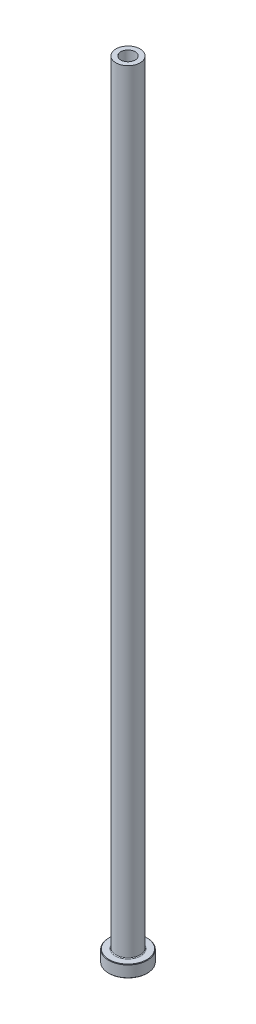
from build123d import *

# Parameters (mm, degrees)
FILLET1_R     = 0.3
CHAMFER1_SIZE = 0.2
CHAMFER3_SIZE = 0.5


with BuildPart() as part:
    # Sketch1 → Revolve1 (revolve)
    with BuildSketch(Plane.XY, mode=Mode.PRIVATE) as revolve1_sk:
        Polygon((-3, 325), (-5, 325), (-5, 5), (-8, 5), (-8, 0), (-3.25, 0), (-3.25, 268), (-3, 280), align=None)
    revolve(revolve1_sk.sketch.rotate(Axis((0, 92.187680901, 0), (0, -1, 0)), 270), axis=Axis((0, 92.187680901, 0), (0, -1, 0)))

    # Fillet1
    fillet1_edges = [part.edges().sort_by_distance(p)[0] for p in [
        (0, 5, -5),
    ]]
    fillet(fillet1_edges, radius=FILLET1_R)

    # Chamfer1
    chamfer1_edges = [part.edges().sort_by_distance(p)[0] for p in [
        (0, 0, -8),
        (0, 5, -8),
    ]]
    chamfer(chamfer1_edges, length=CHAMFER1_SIZE)

    # Chamfer3
    chamfer3_edges = [part.edges().sort_by_distance(p)[0] for p in [
        (0, 0, -3.25),
    ]]
    chamfer(chamfer3_edges, length=CHAMFER3_SIZE)


solid = part.part
